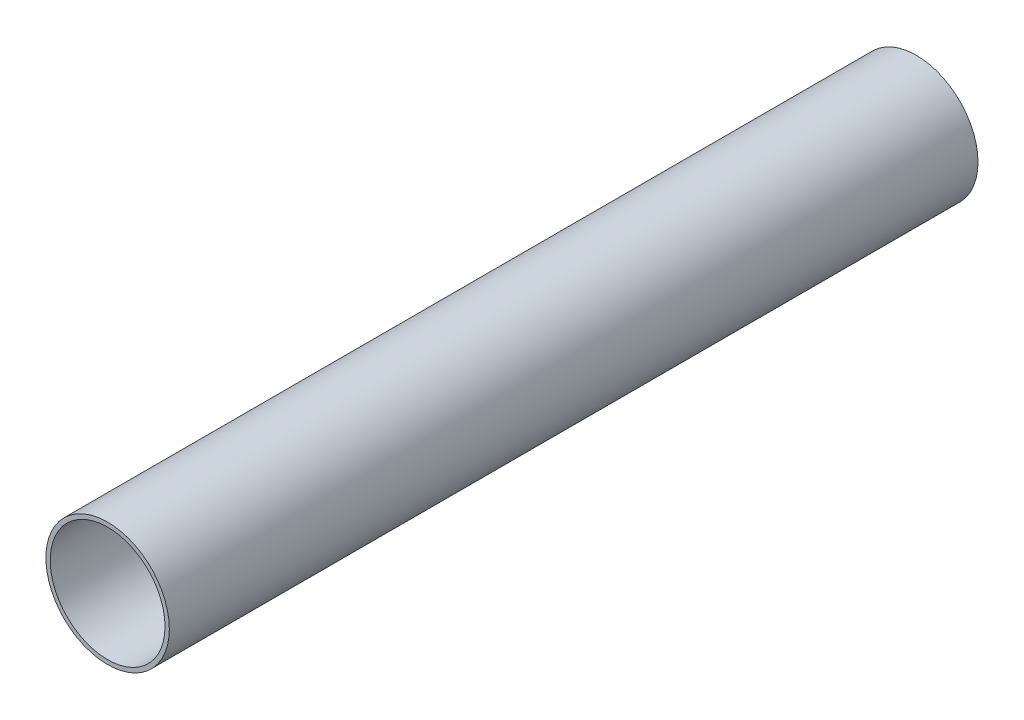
ISO-10303-21;
HEADER;
FILE_DESCRIPTION(('STEP AP214'),'2;1');
FILE_NAME('part.step','',(''),(''),'','','');
FILE_SCHEMA(('AUTOMOTIVE_DESIGN { 1 0 10303 214 1 1 1 1 }'));
ENDSEC;
DATA;
#1=APPLICATION_CONTEXT('core data for automotive mechanical design processes');
#2=APPLICATION_PROTOCOL_DEFINITION('international standard','automotive_design',2000,#1);
#3=PRODUCT_CONTEXT('',#1,'mechanical');
#4=PRODUCT('Part','Part','',(#3));
#5=PRODUCT_RELATED_PRODUCT_CATEGORY('part','',(#4));
#6=PRODUCT_DEFINITION_FORMATION('','',#4);
#7=PRODUCT_DEFINITION_CONTEXT('part definition',#1,'design');
#8=PRODUCT_DEFINITION('design','',#6,#7);
#9=PRODUCT_DEFINITION_SHAPE('','',#8);
#10=(LENGTH_UNIT() NAMED_UNIT(*) SI_UNIT(.MILLI.,.METRE.));
#11=(NAMED_UNIT(*) PLANE_ANGLE_UNIT() SI_UNIT($,.RADIAN.));
#12=(NAMED_UNIT(*) SI_UNIT($,.STERADIAN.) SOLID_ANGLE_UNIT());
#13=UNCERTAINTY_MEASURE_WITH_UNIT(LENGTH_MEASURE(1.E-05),#10,'distance_accuracy_value','');
#14=(GEOMETRIC_REPRESENTATION_CONTEXT(3) GLOBAL_UNCERTAINTY_ASSIGNED_CONTEXT((#13)) GLOBAL_UNIT_ASSIGNED_CONTEXT((#10,
#11,#12)) REPRESENTATION_CONTEXT('',''));
#15=CARTESIAN_POINT('',(0.,0.,0.));
#16=DIRECTION('',(0.,0.,1.));
#17=DIRECTION('',(1.,0.,0.));
#18=AXIS2_PLACEMENT_3D('',#15,#16,#17);
#19=CARTESIAN_POINT('',(0.,0.,381.));
#20=DIRECTION('',(0.,0.,1.));
#21=DIRECTION('',(1.,0.,0.));
#22=AXIS2_PLACEMENT_3D('',#19,#20,#21);
#23=PLANE('',#22);
#24=CARTESIAN_POINT('',(0.,0.,381.));
#25=DIRECTION('',(0.,0.,1.));
#26=DIRECTION('',(1.,0.,0.));
#27=AXIS2_PLACEMENT_3D('',#24,#25,#26);
#28=CIRCLE('',#27,29.083);
#29=CARTESIAN_POINT('',(29.083,0.,381.));
#30=VERTEX_POINT('',#29);
#31=EDGE_CURVE('E10',#30,#30,#28,.T.);
#32=ORIENTED_EDGE('',*,*,#31,.T.);
#33=EDGE_LOOP('',(#32));
#34=FACE_BOUND('',#33,.T.);
#35=CARTESIAN_POINT('',(0.,0.,381.));
#36=DIRECTION('',(0.,0.,1.));
#37=DIRECTION('',(1.,0.,0.));
#38=AXIS2_PLACEMENT_3D('',#35,#36,#37);
#39=CIRCLE('',#38,27.051);
#40=CARTESIAN_POINT('',(27.051,0.,381.));
#41=VERTEX_POINT('',#40);
#42=EDGE_CURVE('E40',#41,#41,#39,.T.);
#43=ORIENTED_EDGE('',*,*,#42,.F.);
#44=EDGE_LOOP('',(#43));
#45=FACE_BOUND('',#44,.T.);
#46=ADVANCED_FACE('F29',(#34,#45),#23,.T.);
#47=CARTESIAN_POINT('',(0.,0.,0.));
#48=DIRECTION('',(0.,0.,1.));
#49=DIRECTION('',(1.,0.,0.));
#50=AXIS2_PLACEMENT_3D('',#47,#48,#49);
#51=PLANE('',#50);
#52=CARTESIAN_POINT('',(0.,0.,0.));
#53=DIRECTION('',(0.,0.,1.));
#54=DIRECTION('',(1.,0.,0.));
#55=AXIS2_PLACEMENT_3D('',#52,#53,#54);
#56=CIRCLE('',#55,29.083);
#57=CARTESIAN_POINT('',(29.083,0.,0.));
#58=VERTEX_POINT('',#57);
#59=EDGE_CURVE('E36',#58,#58,#56,.T.);
#60=ORIENTED_EDGE('',*,*,#59,.F.);
#61=EDGE_LOOP('',(#60));
#62=FACE_BOUND('',#61,.T.);
#63=CARTESIAN_POINT('',(0.,0.,0.));
#64=DIRECTION('',(0.,0.,1.));
#65=DIRECTION('',(1.,0.,0.));
#66=AXIS2_PLACEMENT_3D('',#63,#64,#65);
#67=CIRCLE('',#66,27.051);
#68=CARTESIAN_POINT('',(27.051,0.,0.));
#69=VERTEX_POINT('',#68);
#70=EDGE_CURVE('E44',#69,#69,#67,.T.);
#71=ORIENTED_EDGE('',*,*,#70,.T.);
#72=EDGE_LOOP('',(#71));
#73=FACE_BOUND('',#72,.T.);
#74=ADVANCED_FACE('F50',(#62,#73),#51,.F.);
#75=CARTESIAN_POINT('',(0.,0.,381.));
#76=DIRECTION('',(0.,0.,-1.));
#77=DIRECTION('',(-1.,0.,0.));
#78=AXIS2_PLACEMENT_3D('',#75,#76,#77);
#79=CYLINDRICAL_SURFACE('',#78,29.083);
#80=ORIENTED_EDGE('',*,*,#31,.F.);
#81=EDGE_LOOP('',(#80));
#82=FACE_BOUND('',#81,.T.);
#83=ORIENTED_EDGE('',*,*,#59,.T.);
#84=EDGE_LOOP('',(#83));
#85=FACE_BOUND('',#84,.T.);
#86=ADVANCED_FACE('F31',(#82,#85),#79,.T.);
#87=CARTESIAN_POINT('',(0.,0.,381.));
#88=DIRECTION('',(0.,0.,-1.));
#89=DIRECTION('',(-1.,0.,0.));
#90=AXIS2_PLACEMENT_3D('',#87,#88,#89);
#91=CYLINDRICAL_SURFACE('',#90,27.051);
#92=ORIENTED_EDGE('',*,*,#42,.T.);
#93=EDGE_LOOP('',(#92));
#94=FACE_BOUND('',#93,.T.);
#95=ORIENTED_EDGE('',*,*,#70,.F.);
#96=EDGE_LOOP('',(#95));
#97=FACE_BOUND('',#96,.T.);
#98=ADVANCED_FACE('F52',(#94,#97),#91,.F.);
#99=CLOSED_SHELL('',(#46,#74,#86,#98));
#100=MANIFOLD_SOLID_BREP('B2',#99);
#101=ADVANCED_BREP_SHAPE_REPRESENTATION('',(#18,#100),#14);
#102=SHAPE_DEFINITION_REPRESENTATION(#9,#101);
ENDSEC;
END-ISO-10303-21;
